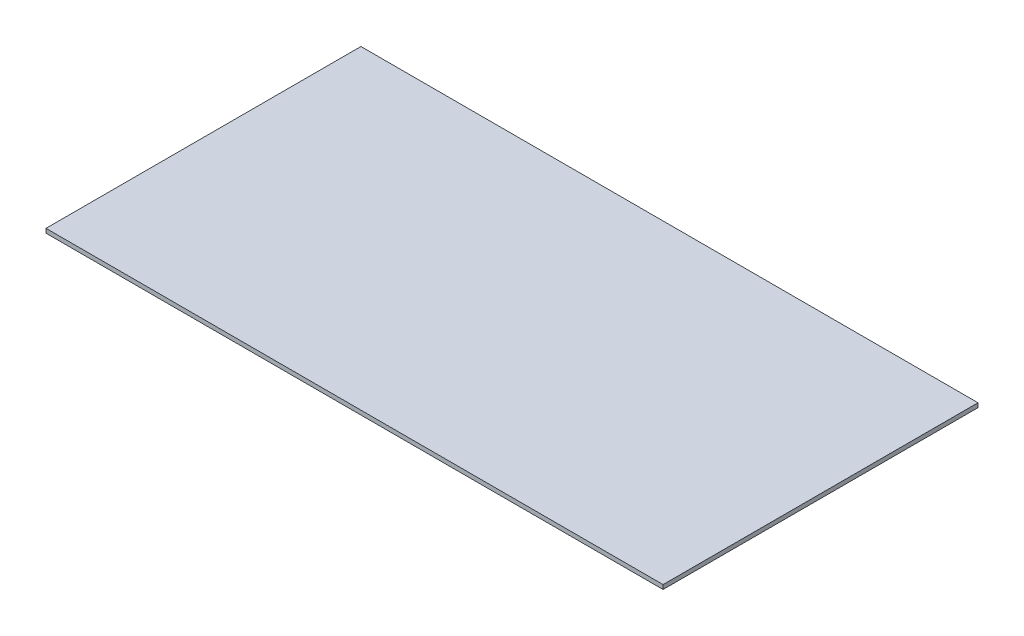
ISO-10303-21;
HEADER;
FILE_DESCRIPTION(('STEP AP214'),'2;1');
FILE_NAME('part.step','',(''),(''),'','','');
FILE_SCHEMA(('AUTOMOTIVE_DESIGN { 1 0 10303 214 1 1 1 1 }'));
ENDSEC;
DATA;
#1=APPLICATION_CONTEXT('core data for automotive mechanical design processes');
#2=APPLICATION_PROTOCOL_DEFINITION('international standard','automotive_design',2000,#1);
#3=PRODUCT_CONTEXT('',#1,'mechanical');
#4=PRODUCT('Part','Part','',(#3));
#5=PRODUCT_RELATED_PRODUCT_CATEGORY('part','',(#4));
#6=PRODUCT_DEFINITION_FORMATION('','',#4);
#7=PRODUCT_DEFINITION_CONTEXT('part definition',#1,'design');
#8=PRODUCT_DEFINITION('design','',#6,#7);
#9=PRODUCT_DEFINITION_SHAPE('','',#8);
#10=(LENGTH_UNIT() NAMED_UNIT(*) SI_UNIT(.MILLI.,.METRE.));
#11=(NAMED_UNIT(*) PLANE_ANGLE_UNIT() SI_UNIT($,.RADIAN.));
#12=(NAMED_UNIT(*) SI_UNIT($,.STERADIAN.) SOLID_ANGLE_UNIT());
#13=UNCERTAINTY_MEASURE_WITH_UNIT(LENGTH_MEASURE(1.E-05),#10,'distance_accuracy_value','');
#14=(GEOMETRIC_REPRESENTATION_CONTEXT(3) GLOBAL_UNCERTAINTY_ASSIGNED_CONTEXT((#13)) GLOBAL_UNIT_ASSIGNED_CONTEXT((#10,
#11,#12)) REPRESENTATION_CONTEXT('',''));
#15=CARTESIAN_POINT('',(0.,0.,0.));
#16=DIRECTION('',(0.,0.,1.));
#17=DIRECTION('',(1.,0.,0.));
#18=AXIS2_PLACEMENT_3D('',#15,#16,#17);
#19=CARTESIAN_POINT('',(0.,0.,222.));
#20=DIRECTION('',(1.,0.,0.));
#21=DIRECTION('',(0.,0.,-1.));
#22=AXIS2_PLACEMENT_3D('',#19,#20,#21);
#23=PLANE('',#22);
#24=DIRECTION('',(0.,-1.,0.));
#25=VECTOR('',#24,1.);
#26=CARTESIAN_POINT('',(0.,0.,0.));
#27=LINE('',#26,#25);
#28=CARTESIAN_POINT('',(0.,3.,0.));
#29=VERTEX_POINT('',#28);
#30=CARTESIAN_POINT('',(0.,0.,0.));
#31=VERTEX_POINT('',#30);
#32=EDGE_CURVE('E94',#29,#31,#27,.T.);
#33=ORIENTED_EDGE('',*,*,#32,.T.);
#34=DIRECTION('',(0.,0.,-1.));
#35=VECTOR('',#34,1.);
#36=CARTESIAN_POINT('',(0.,0.,222.));
#37=LINE('',#36,#35);
#38=CARTESIAN_POINT('',(0.,0.,222.));
#39=VERTEX_POINT('',#38);
#40=EDGE_CURVE('E11',#39,#31,#37,.T.);
#41=ORIENTED_EDGE('',*,*,#40,.F.);
#42=DIRECTION('',(0.,-1.,0.));
#43=VECTOR('',#42,1.);
#44=CARTESIAN_POINT('',(0.,0.,222.));
#45=LINE('',#44,#43);
#46=CARTESIAN_POINT('',(0.,3.,222.));
#47=VERTEX_POINT('',#46);
#48=EDGE_CURVE('E82',#47,#39,#45,.T.);
#49=ORIENTED_EDGE('',*,*,#48,.F.);
#50=DIRECTION('',(0.,0.,-1.));
#51=VECTOR('',#50,1.);
#52=CARTESIAN_POINT('',(0.,3.,222.));
#53=LINE('',#52,#51);
#54=EDGE_CURVE('E90',#47,#29,#53,.T.);
#55=ORIENTED_EDGE('',*,*,#54,.T.);
#56=EDGE_LOOP('',(#33,#41,#49,#55));
#57=FACE_BOUND('',#56,.T.);
#58=ADVANCED_FACE('F31',(#57),#23,.F.);
#59=CARTESIAN_POINT('',(0.,0.,222.));
#60=DIRECTION('',(0.,1.,0.));
#61=DIRECTION('',(0.,0.,1.));
#62=AXIS2_PLACEMENT_3D('',#59,#60,#61);
#63=PLANE('',#62);
#64=DIRECTION('',(1.,0.,0.));
#65=VECTOR('',#64,1.);
#66=CARTESIAN_POINT('',(0.,0.,0.));
#67=LINE('',#66,#65);
#68=CARTESIAN_POINT('',(435.,0.,0.));
#69=VERTEX_POINT('',#68);
#70=EDGE_CURVE('E86',#31,#69,#67,.T.);
#71=ORIENTED_EDGE('',*,*,#70,.T.);
#72=DIRECTION('',(0.,0.,-1.));
#73=VECTOR('',#72,1.);
#74=CARTESIAN_POINT('',(435.,0.,222.));
#75=LINE('',#74,#73);
#76=CARTESIAN_POINT('',(435.,0.,222.));
#77=VERTEX_POINT('',#76);
#78=EDGE_CURVE('E39',#77,#69,#75,.T.);
#79=ORIENTED_EDGE('',*,*,#78,.F.);
#80=DIRECTION('',(1.,0.,0.));
#81=VECTOR('',#80,1.);
#82=CARTESIAN_POINT('',(0.,0.,222.));
#83=LINE('',#82,#81);
#84=EDGE_CURVE('E77',#39,#77,#83,.T.);
#85=ORIENTED_EDGE('',*,*,#84,.F.);
#86=ORIENTED_EDGE('',*,*,#40,.T.);
#87=EDGE_LOOP('',(#71,#79,#85,#86));
#88=FACE_BOUND('',#87,.T.);
#89=ADVANCED_FACE('F85',(#88),#63,.F.);
#90=CARTESIAN_POINT('',(435.,0.,222.));
#91=DIRECTION('',(-1.,0.,0.));
#92=DIRECTION('',(0.,0.,1.));
#93=AXIS2_PLACEMENT_3D('',#90,#91,#92);
#94=PLANE('',#93);
#95=DIRECTION('',(0.,1.,0.));
#96=VECTOR('',#95,1.);
#97=CARTESIAN_POINT('',(435.,0.,0.));
#98=LINE('',#97,#96);
#99=CARTESIAN_POINT('',(435.,3.,0.));
#100=VERTEX_POINT('',#99);
#101=EDGE_CURVE('E64',#69,#100,#98,.T.);
#102=ORIENTED_EDGE('',*,*,#101,.T.);
#103=DIRECTION('',(0.,0.,-1.));
#104=VECTOR('',#103,1.);
#105=CARTESIAN_POINT('',(435.,3.,222.));
#106=LINE('',#105,#104);
#107=CARTESIAN_POINT('',(435.,3.,222.));
#108=VERTEX_POINT('',#107);
#109=EDGE_CURVE('E87',#108,#100,#106,.T.);
#110=ORIENTED_EDGE('',*,*,#109,.F.);
#111=DIRECTION('',(0.,1.,0.));
#112=VECTOR('',#111,1.);
#113=CARTESIAN_POINT('',(435.,0.,222.));
#114=LINE('',#113,#112);
#115=EDGE_CURVE('E80',#77,#108,#114,.T.);
#116=ORIENTED_EDGE('',*,*,#115,.F.);
#117=ORIENTED_EDGE('',*,*,#78,.T.);
#118=EDGE_LOOP('',(#102,#110,#116,#117));
#119=FACE_BOUND('',#118,.T.);
#120=ADVANCED_FACE('F88',(#119),#94,.F.);
#121=CARTESIAN_POINT('',(0.,3.,222.));
#122=DIRECTION('',(0.,-1.,0.));
#123=DIRECTION('',(0.,0.,-1.));
#124=AXIS2_PLACEMENT_3D('',#121,#122,#123);
#125=PLANE('',#124);
#126=DIRECTION('',(-1.,0.,0.));
#127=VECTOR('',#126,1.);
#128=CARTESIAN_POINT('',(0.,3.,0.));
#129=LINE('',#128,#127);
#130=EDGE_CURVE('E70',#100,#29,#129,.T.);
#131=ORIENTED_EDGE('',*,*,#130,.T.);
#132=ORIENTED_EDGE('',*,*,#54,.F.);
#133=DIRECTION('',(-1.,0.,0.));
#134=VECTOR('',#133,1.);
#135=CARTESIAN_POINT('',(0.,3.,222.));
#136=LINE('',#135,#134);
#137=EDGE_CURVE('E47',#108,#47,#136,.T.);
#138=ORIENTED_EDGE('',*,*,#137,.F.);
#139=ORIENTED_EDGE('',*,*,#109,.T.);
#140=EDGE_LOOP('',(#131,#132,#138,#139));
#141=FACE_BOUND('',#140,.T.);
#142=ADVANCED_FACE('F101',(#141),#125,.F.);
#143=CARTESIAN_POINT('',(0.,3.,222.));
#144=DIRECTION('',(0.,0.,-1.));
#145=DIRECTION('',(-1.,0.,0.));
#146=AXIS2_PLACEMENT_3D('',#143,#144,#145);
#147=PLANE('',#146);
#148=ORIENTED_EDGE('',*,*,#48,.T.);
#149=ORIENTED_EDGE('',*,*,#84,.T.);
#150=ORIENTED_EDGE('',*,*,#115,.T.);
#151=ORIENTED_EDGE('',*,*,#137,.T.);
#152=EDGE_LOOP('',(#148,#149,#150,#151));
#153=FACE_BOUND('',#152,.T.);
#154=ADVANCED_FACE('F78',(#153),#147,.F.);
#155=CARTESIAN_POINT('',(0.,3.,0.));
#156=DIRECTION('',(0.,0.,-1.));
#157=DIRECTION('',(-1.,0.,0.));
#158=AXIS2_PLACEMENT_3D('',#155,#156,#157);
#159=PLANE('',#158);
#160=ORIENTED_EDGE('',*,*,#32,.F.);
#161=ORIENTED_EDGE('',*,*,#130,.F.);
#162=ORIENTED_EDGE('',*,*,#101,.F.);
#163=ORIENTED_EDGE('',*,*,#70,.F.);
#164=EDGE_LOOP('',(#160,#161,#162,#163));
#165=FACE_BOUND('',#164,.T.);
#166=ADVANCED_FACE('F104',(#165),#159,.T.);
#167=CLOSED_SHELL('',(#58,#89,#120,#142,#154,#166));
#168=MANIFOLD_SOLID_BREP('B2',#167);
#169=ADVANCED_BREP_SHAPE_REPRESENTATION('',(#18,#168),#14);
#170=SHAPE_DEFINITION_REPRESENTATION(#9,#169);
ENDSEC;
END-ISO-10303-21;
